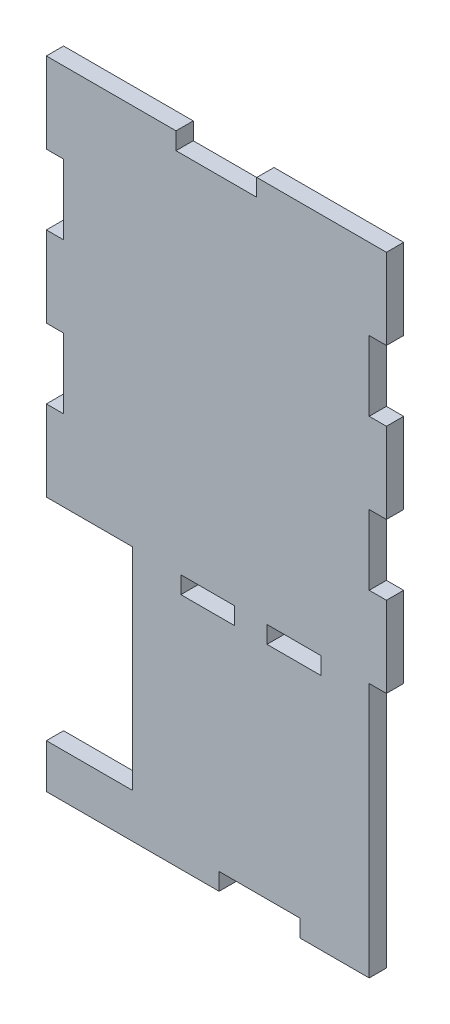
from build123d import *

# Parameters (mm, degrees)
SKETCH2_W           = 50
SKETCH2_H           = 16
BOSS_EXTRUDE2_DEPTH = 16


with BuildPart() as part:
    # Sketch2 → Boss-Extrude2 (new body)
    with BuildSketch(Plane.XY):
        Polygon((204, 103), (204, 180), (220, 180), (220, 255), (204, 255), (204, 320), (220, 320), (220, 395), (204, 395), (204, 460), (220, 460), (220, 535), (99.5, 535), (99.5, 519), (24.5, 519), (24.5, 535), (-96, 535), (-96, 460), (-80, 460), (-80, 395), (-96, 395), (-96, 320), (-80, 320), (-80, 255), (-96, 255), (-96, 180), (-16, 180), (-16, -16), (-96, -16), (-96, -57), (64.5, -57), (64.5, -41), (139.5, -41), (139.5, -57), (204, -57), (204, -37), align=None)
        with Locations((54, 172)):
            Rectangle(SKETCH2_W, SKETCH2_H, mode=Mode.SUBTRACT)
        with Locations((134, 172)):
            Rectangle(SKETCH2_W, SKETCH2_H, mode=Mode.SUBTRACT)
    extrude(amount=BOSS_EXTRUDE2_DEPTH)


solid = part.part
